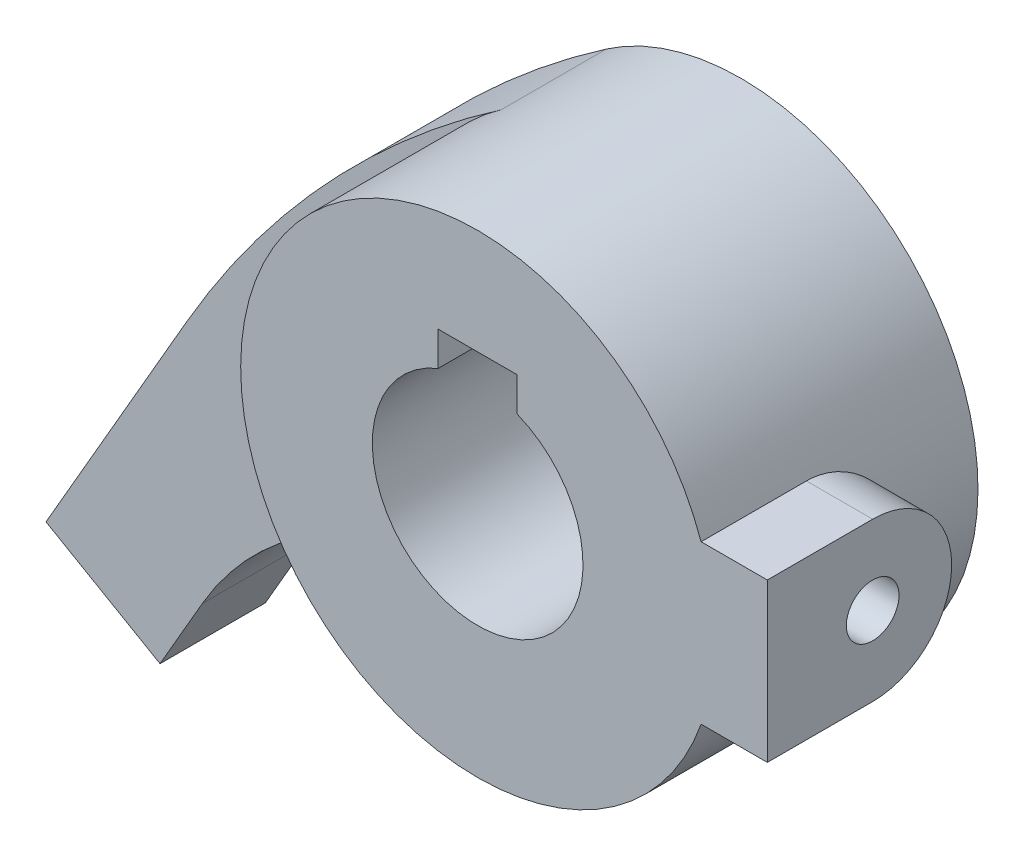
from build123d import *

# Parameters (mm, degrees)
SKETCH_1_R           = 18
EXTRUDE_1_DEPTH      = 20
EXTRUDE_2_REACH      = 50.208
EXTRUDE_2_END_RADIUS = 18
EXTRUDE_3_DEPTH      = 8
SKETCH_4_R           = 2
CUT_EXTRUDE_1_DEPTH  = 20


with BuildPart() as part:
    # Sketch 1 → Extrude 1 (new body)
    with BuildSketch(Plane.XY):
        Circle(SKETCH_1_R)
        with BuildLine():
            Line((-3, 7.416198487), (-3, 10))
            Line((-3, 10), (3, 10))
            Line((3, 10), (3, 7.416198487))
            ThreePointArc((3, 7.416198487), (0, -8), (-3, 7.416198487))
        make_face(mode=Mode.SUBTRACT)
    extrude(amount=EXTRUDE_1_DEPTH)

    # Extrude 2: up to this cylinder (the profile starts outside it)
    extrude_2_end = Plane(origin=(0, 0, 13.573268), z_dir=(0, 0, -1)) * Cylinder(EXTRUDE_2_END_RADIUS, 137.416, mode=Mode.PRIVATE)
    # Sketch 2 → Extrude 2 (add, up to the surface)
    with BuildSketch(Plane(origin=(22, 0, 0), x_dir=(0, 0, -1), z_dir=(1, 0, 0)), mode=Mode.PRIVATE) as extrude_2_sk1:
        with BuildLine():
            Line((-12, 6), (-20, 6))
            Line((-20, 6), (-20, -6))
            Line((-20, -6), (-12, -6))
            ThreePointArc((-12, -6), (-6, 0), (-12, 6))
        make_face()
    extrude_2_tool1 = extrude(extrude_2_sk1.sketch, amount=-EXTRUDE_2_REACH, mode=Mode.PRIVATE) - extrude_2_end
    add(extrude_2_tool1.solids().sort_by_distance((22, 0, 13.573268))[0])

    # Sketch 3 → Extrude 3 (add)
    with BuildSketch(Plane.XY):
        with BuildLine():
            Line((-34.088744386, -11.043437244), (-44.784609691, -29.569219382))
            Line((-44.784609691, -29.569219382), (-36.124355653, -34.569219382))
            Line((-36.124355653, -34.569219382), (-32.908965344, -29))
            ThreePointArc((-32.908965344, -29), (-20.789490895, -18.388163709), (-4.712789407, -17.372093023))
            ThreePointArc((-4.712789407, -17.372093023), (-17.742471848, -3.033923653), (-10.217406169, 14.819062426))
            ThreePointArc((-10.217406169, 14.819062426), (-23.592957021, 3.216837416), (-34.088744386, -11.043437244))
        make_face()
    extrude(amount=EXTRUDE_3_DEPTH)

    # Sketch 4 → Cut-Extrude 1 (cut)
    with BuildSketch(Plane(origin=(22, 0, 0), x_dir=(0, 0, -1), z_dir=(1, 0, 0))):
        with Locations((-12, 0)):
            Circle(SKETCH_4_R)
    extrude(amount=-CUT_EXTRUDE_1_DEPTH, mode=Mode.SUBTRACT)


solid = part.part
